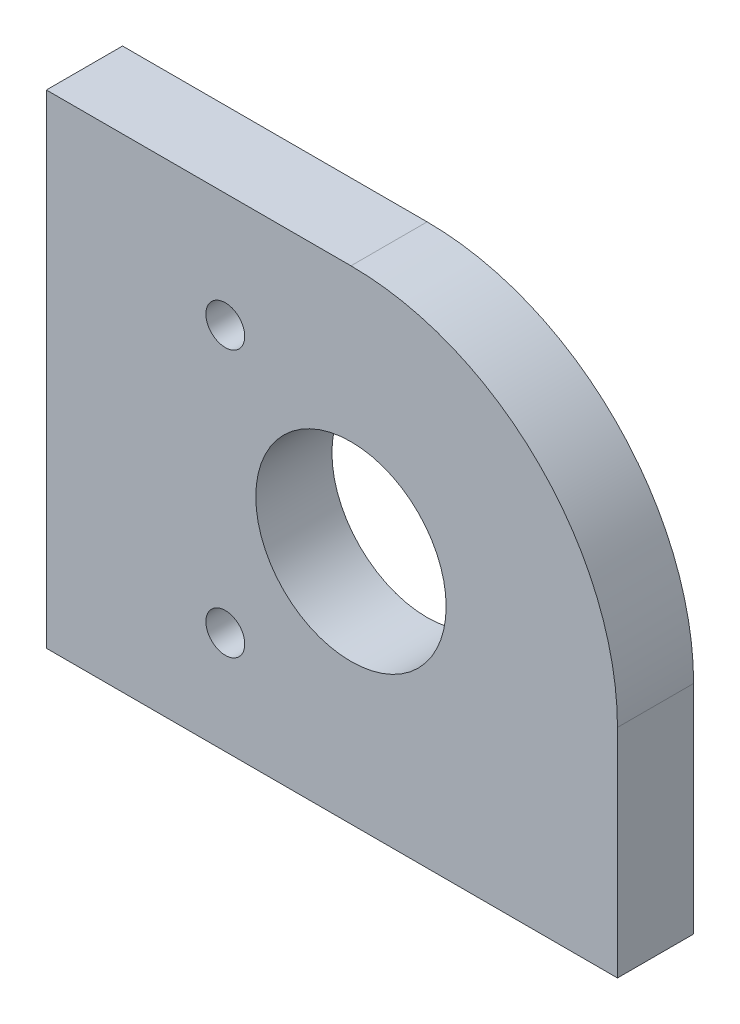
ISO-10303-21;
HEADER;
FILE_DESCRIPTION(('STEP AP214'),'2;1');
FILE_NAME('part.step','',(''),(''),'','','');
FILE_SCHEMA(('AUTOMOTIVE_DESIGN { 1 0 10303 214 1 1 1 1 }'));
ENDSEC;
DATA;
#1=APPLICATION_CONTEXT('core data for automotive mechanical design processes');
#2=APPLICATION_PROTOCOL_DEFINITION('international standard','automotive_design',2000,#1);
#3=PRODUCT_CONTEXT('',#1,'mechanical');
#4=PRODUCT('Part','Part','',(#3));
#5=PRODUCT_RELATED_PRODUCT_CATEGORY('part','',(#4));
#6=PRODUCT_DEFINITION_FORMATION('','',#4);
#7=PRODUCT_DEFINITION_CONTEXT('part definition',#1,'design');
#8=PRODUCT_DEFINITION('design','',#6,#7);
#9=PRODUCT_DEFINITION_SHAPE('','',#8);
#10=(LENGTH_UNIT() NAMED_UNIT(*) SI_UNIT(.MILLI.,.METRE.));
#11=(NAMED_UNIT(*) PLANE_ANGLE_UNIT() SI_UNIT($,.RADIAN.));
#12=(NAMED_UNIT(*) SI_UNIT($,.STERADIAN.) SOLID_ANGLE_UNIT());
#13=UNCERTAINTY_MEASURE_WITH_UNIT(LENGTH_MEASURE(1.E-05),#10,'distance_accuracy_value','');
#14=(GEOMETRIC_REPRESENTATION_CONTEXT(3) GLOBAL_UNCERTAINTY_ASSIGNED_CONTEXT((#13)) GLOBAL_UNIT_ASSIGNED_CONTEXT((#10,
#11,#12)) REPRESENTATION_CONTEXT('',''));
#15=CARTESIAN_POINT('',(0.,0.,0.));
#16=DIRECTION('',(0.,0.,1.));
#17=DIRECTION('',(1.,0.,0.));
#18=AXIS2_PLACEMENT_3D('',#15,#16,#17);
#19=CARTESIAN_POINT('',(0.,-4.99999999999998,20.));
#20=DIRECTION('',(0.,0.,1.));
#21=DIRECTION('',(1.,0.,0.));
#22=AXIS2_PLACEMENT_3D('',#19,#20,#21);
#23=PLANE('',#22);
#24=CARTESIAN_POINT('',(-33.,35.,20.));
#25=DIRECTION('',(0.,0.,1.));
#26=DIRECTION('',(1.,0.,0.));
#27=AXIS2_PLACEMENT_3D('',#24,#25,#26);
#28=CIRCLE('',#27,5.09999999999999);
#29=CARTESIAN_POINT('',(-27.9,35.,20.));
#30=VERTEX_POINT('',#29);
#31=EDGE_CURVE('E161',#30,#30,#28,.T.);
#32=ORIENTED_EDGE('',*,*,#31,.F.);
#33=EDGE_LOOP('',(#32));
#34=FACE_BOUND('',#33,.T.);
#35=CARTESIAN_POINT('',(-33.,-35.,20.));
#36=DIRECTION('',(0.,0.,1.));
#37=DIRECTION('',(1.,0.,0.));
#38=AXIS2_PLACEMENT_3D('',#35,#36,#37);
#39=CIRCLE('',#38,5.09999999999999);
#40=CARTESIAN_POINT('',(-27.9,-35.,20.));
#41=VERTEX_POINT('',#40);
#42=EDGE_CURVE('E165',#41,#41,#39,.T.);
#43=ORIENTED_EDGE('',*,*,#42,.F.);
#44=EDGE_LOOP('',(#43));
#45=FACE_BOUND('',#44,.T.);
#46=CARTESIAN_POINT('',(0.,-4.99999999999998,20.));
#47=DIRECTION('',(0.,0.,1.));
#48=DIRECTION('',(1.,0.,0.));
#49=AXIS2_PLACEMENT_3D('',#46,#47,#48);
#50=CIRCLE('',#49,70.);
#51=CARTESIAN_POINT('',(70.,-5.00000000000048,20.));
#52=VERTEX_POINT('',#51);
#53=CARTESIAN_POINT('',(-4.9960036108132E-13,65.,20.));
#54=VERTEX_POINT('',#53);
#55=EDGE_CURVE('E116',#52,#54,#50,.T.);
#56=ORIENTED_EDGE('',*,*,#55,.T.);
#57=DIRECTION('',(-1.,0.,0.));
#58=VECTOR('',#57,1.);
#59=CARTESIAN_POINT('',(-4.9960036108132E-13,65.,20.));
#60=LINE('',#59,#58);
#61=CARTESIAN_POINT('',(-80.,65.,20.));
#62=VERTEX_POINT('',#61);
#63=EDGE_CURVE('E83',#54,#62,#60,.T.);
#64=ORIENTED_EDGE('',*,*,#63,.T.);
#65=DIRECTION('',(0.,-1.,0.));
#66=VECTOR('',#65,1.);
#67=CARTESIAN_POINT('',(-80.,65.,20.));
#68=LINE('',#67,#66);
#69=CARTESIAN_POINT('',(-80.,-62.,20.));
#70=VERTEX_POINT('',#69);
#71=EDGE_CURVE('E87',#62,#70,#68,.T.);
#72=ORIENTED_EDGE('',*,*,#71,.T.);
#73=DIRECTION('',(1.,0.,0.));
#74=VECTOR('',#73,1.);
#75=CARTESIAN_POINT('',(-80.,-62.,20.));
#76=LINE('',#75,#74);
#77=CARTESIAN_POINT('',(70.,-62.,20.));
#78=VERTEX_POINT('',#77);
#79=EDGE_CURVE('E91',#70,#78,#76,.T.);
#80=ORIENTED_EDGE('',*,*,#79,.T.);
#81=DIRECTION('',(0.,1.,0.));
#82=VECTOR('',#81,1.);
#83=CARTESIAN_POINT('',(70.,-62.,20.));
#84=LINE('',#83,#82);
#85=EDGE_CURVE('E49',#78,#52,#84,.T.);
#86=ORIENTED_EDGE('',*,*,#85,.T.);
#87=EDGE_LOOP('',(#56,#64,#72,#80,#86));
#88=FACE_BOUND('',#87,.T.);
#89=CARTESIAN_POINT('',(0.,0.,20.));
#90=DIRECTION('',(0.,0.,1.));
#91=DIRECTION('',(1.,0.,0.));
#92=AXIS2_PLACEMENT_3D('',#89,#90,#91);
#93=CIRCLE('',#92,25.);
#94=CARTESIAN_POINT('',(25.,0.,20.));
#95=VERTEX_POINT('',#94);
#96=EDGE_CURVE('E111',#95,#95,#93,.T.);
#97=ORIENTED_EDGE('',*,*,#96,.F.);
#98=EDGE_LOOP('',(#97));
#99=FACE_BOUND('',#98,.T.);
#100=ADVANCED_FACE('F32',(#34,#45,#88,#99),#23,.T.);
#101=CARTESIAN_POINT('',(0.,-4.99999999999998,0.));
#102=DIRECTION('',(0.,0.,1.));
#103=DIRECTION('',(1.,0.,0.));
#104=AXIS2_PLACEMENT_3D('',#101,#102,#103);
#105=PLANE('',#104);
#106=CARTESIAN_POINT('',(-33.,35.,0.));
#107=DIRECTION('',(0.,0.,1.));
#108=DIRECTION('',(1.,0.,0.));
#109=AXIS2_PLACEMENT_3D('',#106,#107,#108);
#110=CIRCLE('',#109,5.09999999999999);
#111=CARTESIAN_POINT('',(-27.9,35.,0.));
#112=VERTEX_POINT('',#111);
#113=EDGE_CURVE('E159',#112,#112,#110,.T.);
#114=ORIENTED_EDGE('',*,*,#113,.T.);
#115=EDGE_LOOP('',(#114));
#116=FACE_BOUND('',#115,.T.);
#117=CARTESIAN_POINT('',(-33.,-35.,0.));
#118=DIRECTION('',(0.,0.,1.));
#119=DIRECTION('',(1.,0.,0.));
#120=AXIS2_PLACEMENT_3D('',#117,#118,#119);
#121=CIRCLE('',#120,5.09999999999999);
#122=CARTESIAN_POINT('',(-27.9,-35.,0.));
#123=VERTEX_POINT('',#122);
#124=EDGE_CURVE('E162',#123,#123,#121,.T.);
#125=ORIENTED_EDGE('',*,*,#124,.T.);
#126=EDGE_LOOP('',(#125));
#127=FACE_BOUND('',#126,.T.);
#128=CARTESIAN_POINT('',(0.,-4.99999999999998,0.));
#129=DIRECTION('',(0.,0.,1.));
#130=DIRECTION('',(1.,0.,0.));
#131=AXIS2_PLACEMENT_3D('',#128,#129,#130);
#132=CIRCLE('',#131,70.);
#133=CARTESIAN_POINT('',(70.,-5.00000000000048,0.));
#134=VERTEX_POINT('',#133);
#135=CARTESIAN_POINT('',(-4.9960036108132E-13,65.,0.));
#136=VERTEX_POINT('',#135);
#137=EDGE_CURVE('E107',#134,#136,#132,.T.);
#138=ORIENTED_EDGE('',*,*,#137,.F.);
#139=DIRECTION('',(0.,1.,0.));
#140=VECTOR('',#139,1.);
#141=CARTESIAN_POINT('',(70.,-62.,0.));
#142=LINE('',#141,#140);
#143=CARTESIAN_POINT('',(70.,-62.,0.));
#144=VERTEX_POINT('',#143);
#145=EDGE_CURVE('E75',#144,#134,#142,.T.);
#146=ORIENTED_EDGE('',*,*,#145,.F.);
#147=DIRECTION('',(1.,0.,0.));
#148=VECTOR('',#147,1.);
#149=CARTESIAN_POINT('',(-80.,-62.,0.));
#150=LINE('',#149,#148);
#151=CARTESIAN_POINT('',(-80.,-62.,0.));
#152=VERTEX_POINT('',#151);
#153=EDGE_CURVE('E69',#152,#144,#150,.T.);
#154=ORIENTED_EDGE('',*,*,#153,.F.);
#155=DIRECTION('',(0.,-1.,0.));
#156=VECTOR('',#155,1.);
#157=CARTESIAN_POINT('',(-80.,65.,0.));
#158=LINE('',#157,#156);
#159=CARTESIAN_POINT('',(-80.,65.,0.));
#160=VERTEX_POINT('',#159);
#161=EDGE_CURVE('E98',#160,#152,#158,.T.);
#162=ORIENTED_EDGE('',*,*,#161,.F.);
#163=DIRECTION('',(-1.,0.,0.));
#164=VECTOR('',#163,1.);
#165=CARTESIAN_POINT('',(-4.9960036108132E-13,65.,0.));
#166=LINE('',#165,#164);
#167=EDGE_CURVE('E110',#136,#160,#166,.T.);
#168=ORIENTED_EDGE('',*,*,#167,.F.);
#169=EDGE_LOOP('',(#138,#146,#154,#162,#168));
#170=FACE_BOUND('',#169,.T.);
#171=CARTESIAN_POINT('',(0.,0.,0.));
#172=DIRECTION('',(0.,0.,1.));
#173=DIRECTION('',(1.,0.,0.));
#174=AXIS2_PLACEMENT_3D('',#171,#172,#173);
#175=CIRCLE('',#174,25.);
#176=CARTESIAN_POINT('',(25.,0.,0.));
#177=VERTEX_POINT('',#176);
#178=EDGE_CURVE('E171',#177,#177,#175,.T.);
#179=ORIENTED_EDGE('',*,*,#178,.T.);
#180=EDGE_LOOP('',(#179));
#181=FACE_BOUND('',#180,.T.);
#182=ADVANCED_FACE('F120',(#116,#127,#170,#181),#105,.F.);
#183=CARTESIAN_POINT('',(0.,-4.99999999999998,20.));
#184=DIRECTION('',(0.,0.,-1.));
#185=DIRECTION('',(-1.,0.,0.));
#186=AXIS2_PLACEMENT_3D('',#183,#184,#185);
#187=CYLINDRICAL_SURFACE('',#186,70.);
#188=ORIENTED_EDGE('',*,*,#137,.T.);
#189=DIRECTION('',(0.,0.,-1.));
#190=VECTOR('',#189,1.);
#191=CARTESIAN_POINT('',(-4.9960036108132E-13,65.,20.));
#192=LINE('',#191,#190);
#193=EDGE_CURVE('E11',#54,#136,#192,.T.);
#194=ORIENTED_EDGE('',*,*,#193,.F.);
#195=ORIENTED_EDGE('',*,*,#55,.F.);
#196=DIRECTION('',(0.,0.,-1.));
#197=VECTOR('',#196,1.);
#198=CARTESIAN_POINT('',(70.,-5.00000000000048,20.));
#199=LINE('',#198,#197);
#200=EDGE_CURVE('E103',#52,#134,#199,.T.);
#201=ORIENTED_EDGE('',*,*,#200,.T.);
#202=EDGE_LOOP('',(#188,#194,#195,#201));
#203=FACE_BOUND('',#202,.T.);
#204=ADVANCED_FACE('F34',(#203),#187,.T.);
#205=CARTESIAN_POINT('',(-4.9960036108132E-13,65.,20.));
#206=DIRECTION('',(0.,-1.,0.));
#207=DIRECTION('',(1.,0.,0.));
#208=AXIS2_PLACEMENT_3D('',#205,#206,#207);
#209=PLANE('',#208);
#210=ORIENTED_EDGE('',*,*,#167,.T.);
#211=DIRECTION('',(0.,0.,-1.));
#212=VECTOR('',#211,1.);
#213=CARTESIAN_POINT('',(-80.,65.,20.));
#214=LINE('',#213,#212);
#215=EDGE_CURVE('E41',#62,#160,#214,.T.);
#216=ORIENTED_EDGE('',*,*,#215,.F.);
#217=ORIENTED_EDGE('',*,*,#63,.F.);
#218=ORIENTED_EDGE('',*,*,#193,.T.);
#219=EDGE_LOOP('',(#210,#216,#217,#218));
#220=FACE_BOUND('',#219,.T.);
#221=ADVANCED_FACE('F213',(#220),#209,.F.);
#222=CARTESIAN_POINT('',(-80.,65.,20.));
#223=DIRECTION('',(1.,0.,0.));
#224=DIRECTION('',(0.,0.,-1.));
#225=AXIS2_PLACEMENT_3D('',#222,#223,#224);
#226=PLANE('',#225);
#227=ORIENTED_EDGE('',*,*,#161,.T.);
#228=DIRECTION('',(0.,0.,-1.));
#229=VECTOR('',#228,1.);
#230=CARTESIAN_POINT('',(-80.,-62.,20.));
#231=LINE('',#230,#229);
#232=EDGE_CURVE('E95',#70,#152,#231,.T.);
#233=ORIENTED_EDGE('',*,*,#232,.F.);
#234=ORIENTED_EDGE('',*,*,#71,.F.);
#235=ORIENTED_EDGE('',*,*,#215,.T.);
#236=EDGE_LOOP('',(#227,#233,#234,#235));
#237=FACE_BOUND('',#236,.T.);
#238=ADVANCED_FACE('F96',(#237),#226,.F.);
#239=CARTESIAN_POINT('',(-80.,-62.,20.));
#240=DIRECTION('',(0.,1.,0.));
#241=DIRECTION('',(0.,0.,1.));
#242=AXIS2_PLACEMENT_3D('',#239,#240,#241);
#243=PLANE('',#242);
#244=ORIENTED_EDGE('',*,*,#153,.T.);
#245=DIRECTION('',(0.,0.,-1.));
#246=VECTOR('',#245,1.);
#247=CARTESIAN_POINT('',(70.,-62.,20.));
#248=LINE('',#247,#246);
#249=EDGE_CURVE('E99',#78,#144,#248,.T.);
#250=ORIENTED_EDGE('',*,*,#249,.F.);
#251=ORIENTED_EDGE('',*,*,#79,.F.);
#252=ORIENTED_EDGE('',*,*,#232,.T.);
#253=EDGE_LOOP('',(#244,#250,#251,#252));
#254=FACE_BOUND('',#253,.T.);
#255=ADVANCED_FACE('F101',(#254),#243,.F.);
#256=CARTESIAN_POINT('',(70.,-62.,20.));
#257=DIRECTION('',(-1.,0.,0.));
#258=DIRECTION('',(0.,0.,1.));
#259=AXIS2_PLACEMENT_3D('',#256,#257,#258);
#260=PLANE('',#259);
#261=ORIENTED_EDGE('',*,*,#145,.T.);
#262=ORIENTED_EDGE('',*,*,#200,.F.);
#263=ORIENTED_EDGE('',*,*,#85,.F.);
#264=ORIENTED_EDGE('',*,*,#249,.T.);
#265=EDGE_LOOP('',(#261,#262,#263,#264));
#266=FACE_BOUND('',#265,.T.);
#267=ADVANCED_FACE('F125',(#266),#260,.F.);
#268=CARTESIAN_POINT('',(0.,0.,20.));
#269=DIRECTION('',(0.,0.,-1.));
#270=DIRECTION('',(-1.,0.,0.));
#271=AXIS2_PLACEMENT_3D('',#268,#269,#270);
#272=CYLINDRICAL_SURFACE('',#271,25.);
#273=ORIENTED_EDGE('',*,*,#96,.T.);
#274=EDGE_LOOP('',(#273));
#275=FACE_BOUND('',#274,.T.);
#276=ORIENTED_EDGE('',*,*,#178,.F.);
#277=EDGE_LOOP('',(#276));
#278=FACE_BOUND('',#277,.T.);
#279=ADVANCED_FACE('F127',(#275,#278),#272,.F.);
#280=CARTESIAN_POINT('',(-33.,-35.,20.));
#281=DIRECTION('',(0.,0.,1.));
#282=DIRECTION('',(1.,0.,0.));
#283=AXIS2_PLACEMENT_3D('',#280,#281,#282);
#284=CYLINDRICAL_SURFACE('',#283,5.09999999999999);
#285=ORIENTED_EDGE('',*,*,#124,.F.);
#286=EDGE_LOOP('',(#285));
#287=FACE_BOUND('',#286,.T.);
#288=ORIENTED_EDGE('',*,*,#42,.T.);
#289=EDGE_LOOP('',(#288));
#290=FACE_BOUND('',#289,.T.);
#291=ADVANCED_FACE('F133',(#287,#290),#284,.F.);
#292=CARTESIAN_POINT('',(-33.,35.,20.));
#293=DIRECTION('',(0.,0.,1.));
#294=DIRECTION('',(1.,0.,0.));
#295=AXIS2_PLACEMENT_3D('',#292,#293,#294);
#296=CYLINDRICAL_SURFACE('',#295,5.09999999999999);
#297=ORIENTED_EDGE('',*,*,#113,.F.);
#298=EDGE_LOOP('',(#297));
#299=FACE_BOUND('',#298,.T.);
#300=ORIENTED_EDGE('',*,*,#31,.T.);
#301=EDGE_LOOP('',(#300));
#302=FACE_BOUND('',#301,.T.);
#303=ADVANCED_FACE('F150',(#299,#302),#296,.F.);
#304=CLOSED_SHELL('',(#100,#182,#204,#221,#238,#255,#267,#279,#291,#303));
#305=MANIFOLD_SOLID_BREP('B2',#304);
#306=ADVANCED_BREP_SHAPE_REPRESENTATION('',(#18,#305),#14);
#307=SHAPE_DEFINITION_REPRESENTATION(#9,#306);
ENDSEC;
END-ISO-10303-21;
